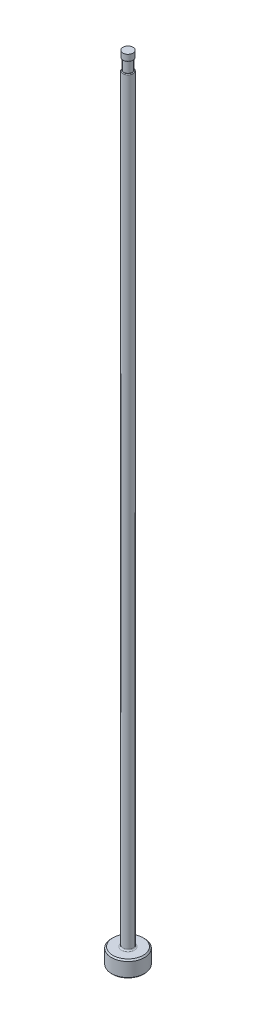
from build123d import *

# Parameters (mm, degrees)
CHAMFER1_SIZE     = 0.254
FILLET1_R         = 0.254
SKETCH2_W         = 0.2032
SKETCH2_H         = 2.032
D_SLOT_DEPTH      = 153.466131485
D_SLOT_DEPTH_BACK = 153.466131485
SKETCH5_W         = 0.0127
SKETCH5_H         = 1.27
FILLET2_R         = 0.127


with BuildPart() as part:
    # Sketch1 → Revolve1 (revolve)
    with BuildSketch(Plane.XY, mode=Mode.PRIVATE) as revolve1_sk:
        Polygon((0, 0), (-3.175, 0), (-3.175, 3.175), (-0.99187, 3.175), (-0.99187, 152.4), (0, 152.4), align=None)
    revolve(revolve1_sk.sketch.rotate(Axis((0, 259.958771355, 0), (0, -1, 0)), 270), axis=Axis((0, 259.958771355, 0), (0, -1, 0)))

    # Chamfer1
    chamfer1_edges = [part.edges().sort_by_distance(p)[0] for p in [
        (0, 3.175, -3.175),
        (0, 0, -3.175),
    ]]
    chamfer(chamfer1_edges, length=CHAMFER1_SIZE)

    # Fillet1
    fillet1_edges = [part.edges().sort_by_distance(p)[0] for p in [
        (0, 3.175, -0.99187),
    ]]
    fillet(fillet1_edges, radius=FILLET1_R)

    # Sketch2 → Vent Relief (revolve, cut)
    with BuildSketch(Plane.XY, mode=Mode.PRIVATE) as vent_relief_sk:
        with Locations((-0.89027, 150.114)):
            Rectangle(SKETCH2_W, SKETCH2_H)
    revolve(vent_relief_sk.sketch.rotate(Axis((0, 153.448281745, 0), (0, -1, 0)), 270), axis=Axis((0, 153.448281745, 0), (0, -1, 0)), mode=Mode.SUBTRACT)

    # Sketch3 → D-Slot (cut, two sides: drawn at the far end of the back side and taken through both)
    with BuildSketch(Plane.XY.offset(-D_SLOT_DEPTH_BACK)):
        with BuildLine():
            Line((-0.78867, 150.114), (-0.78867, 86.614))
            ThreePointArc((-0.78867, 86.614), (-0.839883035, 86.046038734), (-0.99187, 85.4964))
            Line((-0.99187, 85.4964), (-0.99187, 150.114))
            Line((-0.99187, 150.114), (-0.78867, 150.114))
        make_face()
    extrude(amount=D_SLOT_DEPTH + D_SLOT_DEPTH_BACK, mode=Mode.SUBTRACT)

    # Sketch5 → Vent Diameter (revolve, cut)
    with BuildSketch(Plane.XY, mode=Mode.PRIVATE) as vent_diameter_sk:
        with Locations((-0.98552, 151.765)):
            Rectangle(SKETCH5_W, SKETCH5_H)
    revolve(vent_diameter_sk.sketch.rotate(Axis((0, 152.687735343, 0), (0, -1, 0)), 90), axis=Axis((0, 152.687735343, 0), (0, -1, 0)), mode=Mode.SUBTRACT)

    # Fillet2
    fillet2_edges = [part.edges().sort_by_distance(p)[0] for p in [
        (0.888937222, 149.098, -0.439996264),
        (0, 151.13, 0.97917),
    ]]
    fillet(fillet2_edges, radius=FILLET2_R)


solid = part.part
